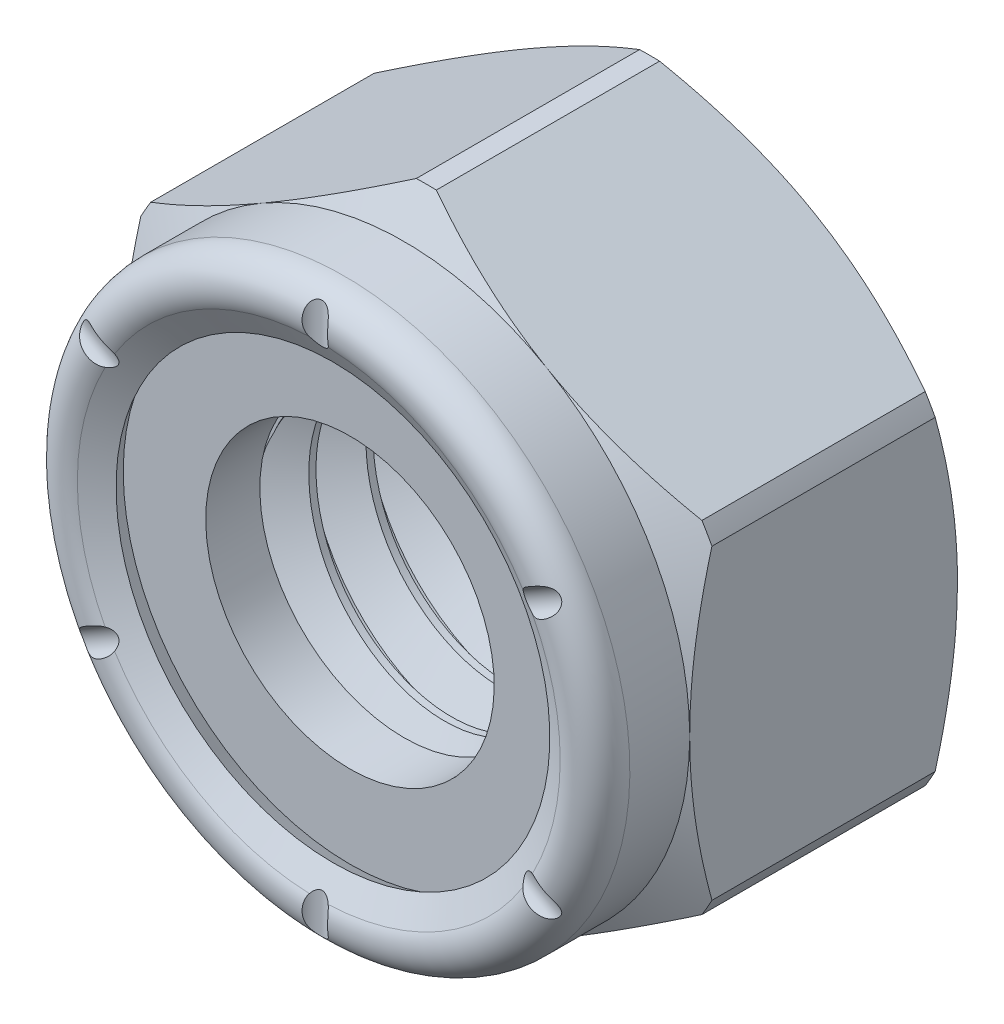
from build123d import *

# Parameters (mm, degrees)
CUT_EXTRUDE1_DEPTH           = 8.435435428
CUT_EXTRUDE1_DEPTH_BACK      = 8.435435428
SKETCH4_OUTSIDE_W            = 13.756
SKETCH4_OUTSIDE_H            = 13.756
CUT_EXTRUDE2_DEPTH           = 8.118574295
CUT_EXTRUDE2_DEPTH_BACK      = 8.118574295
SKETCH5_R                    = 2.5
SKETCH12_W                   = 0.20625
SKETCH12_H                   = 1.5
CIRPATTERN1_COUNT            = 6
SKETCH7_W                    = 0.758114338
SKETCH7_H                    = 1.705
SWEEP1_PITCH                 = 0.8
SWEEP1_HEIGHT                = 4.55
SWEEP1_RADIUS                = 2.5
SWEEP1_START_ANGLE           = 90
SKETCH10_R                   = 2.75
CUT_EXTRUDE3_OTHER_WAY_DEPTH = 8.849305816


with BuildPart() as part:
    # Sketch3 → Revolve1 (revolve)
    with BuildSketch(Plane(origin=(0, 0, 0), x_dir=(0, 0, -1), z_dir=(1, 0, 0)), mode=Mode.PRIVATE) as revolve1_sk:
        Polygon((3.75, 0), (3.75, 4), (3.438230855, 4.54), (0.311769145, 4.54), (0, 4), (0, 0), align=None)
    revolve(revolve1_sk.sketch.rotate(Axis((0, 0, 1.25), (0, 0, -1)), 180), axis=Axis((0, 0, 1.25), (0, 0, -1)))

    # Sketch4 outside → Cut-Extrude1 (cut, two sides: drawn at the far end of the back side and taken through both)
    with BuildSketch(Plane.XY.offset(-CUT_EXTRUDE1_DEPTH_BACK)):
        Rectangle(SKETCH4_OUTSIDE_W, SKETCH4_OUTSIDE_H)
        Polygon((4, -2.309401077), (4, 2.309401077), (0, 4.618802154), (-4, 2.309401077), (-4, -2.309401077), (0, -4.618802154), align=None, mode=Mode.SUBTRACT)
    extrude(amount=CUT_EXTRUDE1_DEPTH + CUT_EXTRUDE1_DEPTH_BACK, mode=Mode.SUBTRACT)

    # Sketch5 → Cut-Extrude2 (cut, two sides: drawn at the far end of the back side and taken through both)
    with BuildSketch(Plane.XY.offset(-CUT_EXTRUDE2_DEPTH_BACK)):
        Circle(SKETCH5_R)
    extrude(amount=CUT_EXTRUDE2_DEPTH + CUT_EXTRUDE2_DEPTH_BACK, mode=Mode.SUBTRACT)

    # Sketch6 → Revolve3 (revolve)
    with BuildSketch(Plane(origin=(0, 0, 0), x_dir=(0, 0, -1), z_dir=(1, 0, 0)), mode=Mode.PRIVATE) as revolve3_sk:
        with BuildLine():
            Line((-0.758114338, 3.175), (-0.956578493, 3.51875))
            ThreePointArc((-0.956578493, 3.51875), (-0.956578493, 3.65625), (-0.8375, 3.725))
            Line((-0.8375, 3.725), (0, 3.725))
            Line((0, 3.725), (0, 4))
            Line((0, 4), (-0.8375, 4))
            ThreePointArc((-0.8375, 4), (-1.194735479, 3.79375), (-1.194735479, 3.38125))
            Line((-1.194735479, 3.38125), (-0.996271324, 3.0375))
            Line((-0.996271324, 3.0375), (-0.758114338, 3.175))
        make_face()
    revolve(revolve3_sk.sketch.rotate(Axis((0, 0, 1.25), (0, 0, -1)), 180), axis=Axis((0, 0, 1.25), (0, 0, -1)))

    # Sketch12 → Cut-Revolve1 (revolve, cut)
    with BuildSketch(Plane(origin=(0, 0, 0), x_dir=(0, 0, -1), z_dir=(1, 0, 0))):
        with Locations((-1.25, 3.25)):
            Rectangle(SKETCH12_W, SKETCH12_H)
    cut_revolve1 = revolve(axis=Axis((0, 4, 1.353125), (0, -1, 0)), mode=Mode.SUBTRACT)

    # CirPattern1: Cut-Revolve1 ×6 about axis
    cirpattern1_axis = Axis((0, 0, 1.25), (0, 0, -1))
    for i in range(1, CIRPATTERN1_COUNT):
        add(cut_revolve1.rotate(cirpattern1_axis, i * 360 / CIRPATTERN1_COUNT), mode=Mode.SUBTRACT)


with BuildPart() as body_2:
    # Sketch7 → Revolve2 (revolve)
    with BuildSketch(Plane(origin=(0, 0, 0), x_dir=(0, 0, -1), z_dir=(1, 0, 0)), mode=Mode.PRIVATE) as revolve2_sk:
        with Locations((-0.379057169, 2.8725)):
            Rectangle(SKETCH7_W, SKETCH7_H)
    revolve(revolve2_sk.sketch.rotate(Axis((0, 0, 1.25), (0, 0, -1)), 180), axis=Axis((0, 0, 1.25), (0, 0, -1)))


with BuildPart() as body_3:
    # Split1: the piece on the far side of the plane
    add(part.part)
    split(bisect_by=Plane.XY, keep=Keep.BOTTOM)

    # Sweep1: sweep along a helix
    with BuildLine() as sweep1_path:
        add(Helix(SWEEP1_PITCH, SWEEP1_HEIGHT, SWEEP1_RADIUS, center=(0, 0, -3.75), direction=(0, 0, 1), mode=Mode.PRIVATE).rotate(Axis((0, 0, -3.75), (0, 0, 1)), SWEEP1_START_ANGLE))
    # Sketch9 → Sweep1 (sweep)
    with BuildSketch(Plane(origin=(0, 0, 0), x_dir=(0, 0, -1), z_dir=(1, 0, 0))):
        Polygon((4.05, 1.980384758), (4.15, 1.980384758), (4.475, 2.54330127), (3.725, 2.54330127), align=None)
    sweep(path=sweep1_path.line, is_frenet=True)

    # Cut-Extrude3 cone 1 section (on through the dimple's axis) → Cut-Extrude3 (revolve, cut)
    with BuildSketch(Plane(origin=(0, 0, -3.75), x_dir=(0, 1, 0), z_dir=(1, 0, 0))):
        Polygon((0, 0), (2.75, 0), (0, 2.75), align=None)
    revolve(axis=Axis((0, 0, -3.75), (0, 0, 1)), mode=Mode.SUBTRACT)

    # Sketch10 → Cut-Extrude3 other way (cut)
    with BuildSketch(Plane(origin=(0, 0, -3.75), x_dir=(-1, 0, 0), z_dir=(0, 0, -1))):
        Circle(SKETCH10_R)
    extrude(amount=CUT_EXTRUDE3_OTHER_WAY_DEPTH, mode=Mode.SUBTRACT)

    # SurfaceCut1
    split(bisect_by=Plane.XY, keep=Keep.BOTTOM)


with BuildPart() as part_1:
    add(part.part)

    # Split1
    split(bisect_by=Plane.XY, keep=Keep.TOP)

    # Combine1: union body 3
    add(body_3.part)


solid = Compound([body_2.part, part_1.part])
